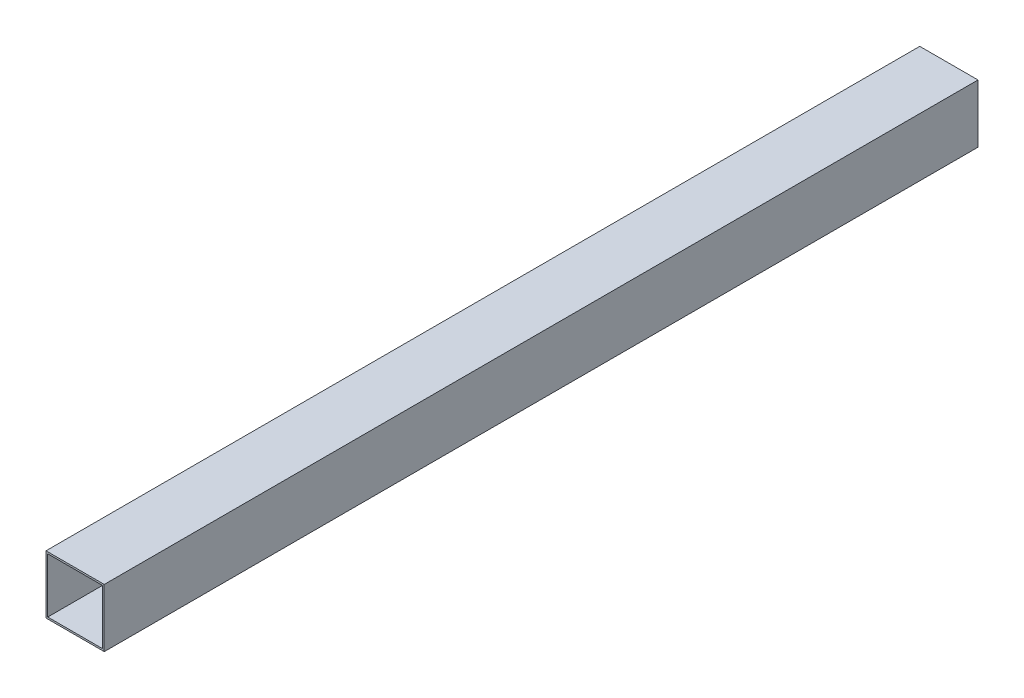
ISO-10303-21;
HEADER;
FILE_DESCRIPTION(('STEP AP214'),'2;1');
FILE_NAME('part.step','',(''),(''),'','','');
FILE_SCHEMA(('AUTOMOTIVE_DESIGN { 1 0 10303 214 1 1 1 1 }'));
ENDSEC;
DATA;
#1=APPLICATION_CONTEXT('core data for automotive mechanical design processes');
#2=APPLICATION_PROTOCOL_DEFINITION('international standard','automotive_design',2000,#1);
#3=PRODUCT_CONTEXT('',#1,'mechanical');
#4=PRODUCT('Part','Part','',(#3));
#5=PRODUCT_RELATED_PRODUCT_CATEGORY('part','',(#4));
#6=PRODUCT_DEFINITION_FORMATION('','',#4);
#7=PRODUCT_DEFINITION_CONTEXT('part definition',#1,'design');
#8=PRODUCT_DEFINITION('design','',#6,#7);
#9=PRODUCT_DEFINITION_SHAPE('','',#8);
#10=(LENGTH_UNIT() NAMED_UNIT(*) SI_UNIT(.MILLI.,.METRE.));
#11=(NAMED_UNIT(*) PLANE_ANGLE_UNIT() SI_UNIT($,.RADIAN.));
#12=(NAMED_UNIT(*) SI_UNIT($,.STERADIAN.) SOLID_ANGLE_UNIT());
#13=UNCERTAINTY_MEASURE_WITH_UNIT(LENGTH_MEASURE(1.E-05),#10,'distance_accuracy_value','');
#14=(GEOMETRIC_REPRESENTATION_CONTEXT(3) GLOBAL_UNCERTAINTY_ASSIGNED_CONTEXT((#13)) GLOBAL_UNIT_ASSIGNED_CONTEXT((#10,
#11,#12)) REPRESENTATION_CONTEXT('',''));
#15=CARTESIAN_POINT('',(0.,0.,0.));
#16=DIRECTION('',(0.,0.,1.));
#17=DIRECTION('',(1.,0.,0.));
#18=AXIS2_PLACEMENT_3D('',#15,#16,#17);
#19=CARTESIAN_POINT('',(0.,0.,600.));
#20=DIRECTION('',(0.,0.,1.));
#21=DIRECTION('',(1.,0.,0.));
#22=AXIS2_PLACEMENT_3D('',#19,#20,#21);
#23=PLANE('',#22);
#24=DIRECTION('',(0.,1.,0.));
#25=VECTOR('',#24,1.);
#26=CARTESIAN_POINT('',(20.,-20.,600.));
#27=LINE('',#26,#25);
#28=CARTESIAN_POINT('',(20.,-20.,600.));
#29=VERTEX_POINT('',#28);
#30=CARTESIAN_POINT('',(20.,20.,600.));
#31=VERTEX_POINT('',#30);
#32=EDGE_CURVE('E162',#29,#31,#27,.T.);
#33=ORIENTED_EDGE('',*,*,#32,.T.);
#34=DIRECTION('',(-1.,0.,0.));
#35=VECTOR('',#34,1.);
#36=CARTESIAN_POINT('',(-20.,20.,600.));
#37=LINE('',#36,#35);
#38=CARTESIAN_POINT('',(-20.,20.,600.));
#39=VERTEX_POINT('',#38);
#40=EDGE_CURVE('E165',#31,#39,#37,.T.);
#41=ORIENTED_EDGE('',*,*,#40,.T.);
#42=DIRECTION('',(0.,-1.,0.));
#43=VECTOR('',#42,1.);
#44=CARTESIAN_POINT('',(-20.,-20.,600.));
#45=LINE('',#44,#43);
#46=CARTESIAN_POINT('',(-20.,-20.,600.));
#47=VERTEX_POINT('',#46);
#48=EDGE_CURVE('E168',#39,#47,#45,.T.);
#49=ORIENTED_EDGE('',*,*,#48,.T.);
#50=DIRECTION('',(1.,0.,0.));
#51=VECTOR('',#50,1.);
#52=CARTESIAN_POINT('',(-20.,-20.,600.));
#53=LINE('',#52,#51);
#54=EDGE_CURVE('E170',#47,#29,#53,.T.);
#55=ORIENTED_EDGE('',*,*,#54,.T.);
#56=EDGE_LOOP('',(#33,#41,#49,#55));
#57=FACE_BOUND('',#56,.T.);
#58=DIRECTION('',(-1.,0.,0.));
#59=VECTOR('',#58,1.);
#60=CARTESIAN_POINT('',(0.,18.8,600.));
#61=LINE('',#60,#59);
#62=CARTESIAN_POINT('',(18.8,18.8,600.));
#63=VERTEX_POINT('',#62);
#64=CARTESIAN_POINT('',(-18.8,18.8,600.));
#65=VERTEX_POINT('',#64);
#66=EDGE_CURVE('E134',#63,#65,#61,.T.);
#67=ORIENTED_EDGE('',*,*,#66,.F.);
#68=DIRECTION('',(0.,1.,0.));
#69=VECTOR('',#68,1.);
#70=CARTESIAN_POINT('',(18.8,0.,600.));
#71=LINE('',#70,#69);
#72=CARTESIAN_POINT('',(18.8,-18.8,600.));
#73=VERTEX_POINT('',#72);
#74=EDGE_CURVE('E126',#73,#63,#71,.T.);
#75=ORIENTED_EDGE('',*,*,#74,.F.);
#76=DIRECTION('',(1.,0.,0.));
#77=VECTOR('',#76,1.);
#78=CARTESIAN_POINT('',(0.,-18.8,600.));
#79=LINE('',#78,#77);
#80=CARTESIAN_POINT('',(-18.8,-18.8,600.));
#81=VERTEX_POINT('',#80);
#82=EDGE_CURVE('E148',#81,#73,#79,.T.);
#83=ORIENTED_EDGE('',*,*,#82,.F.);
#84=DIRECTION('',(0.,-1.,0.));
#85=VECTOR('',#84,1.);
#86=CARTESIAN_POINT('',(-18.8,0.,600.));
#87=LINE('',#86,#85);
#88=EDGE_CURVE('E146',#65,#81,#87,.T.);
#89=ORIENTED_EDGE('',*,*,#88,.F.);
#90=EDGE_LOOP('',(#67,#75,#83,#89));
#91=FACE_BOUND('',#90,.T.);
#92=ADVANCED_FACE('F61',(#57,#91),#23,.T.);
#93=CARTESIAN_POINT('',(0.,0.,0.));
#94=DIRECTION('',(0.,0.,1.));
#95=DIRECTION('',(1.,0.,0.));
#96=AXIS2_PLACEMENT_3D('',#93,#94,#95);
#97=PLANE('',#96);
#98=DIRECTION('',(0.,1.,0.));
#99=VECTOR('',#98,1.);
#100=CARTESIAN_POINT('',(20.,-20.,0.));
#101=LINE('',#100,#99);
#102=CARTESIAN_POINT('',(20.,-20.,0.));
#103=VERTEX_POINT('',#102);
#104=CARTESIAN_POINT('',(20.,20.,0.));
#105=VERTEX_POINT('',#104);
#106=EDGE_CURVE('E142',#103,#105,#101,.T.);
#107=ORIENTED_EDGE('',*,*,#106,.F.);
#108=DIRECTION('',(1.,0.,0.));
#109=VECTOR('',#108,1.);
#110=CARTESIAN_POINT('',(-20.,-20.,0.));
#111=LINE('',#110,#109);
#112=CARTESIAN_POINT('',(-20.,-20.,0.));
#113=VERTEX_POINT('',#112);
#114=EDGE_CURVE('E166',#113,#103,#111,.T.);
#115=ORIENTED_EDGE('',*,*,#114,.F.);
#116=DIRECTION('',(0.,-1.,0.));
#117=VECTOR('',#116,1.);
#118=CARTESIAN_POINT('',(-20.,-20.,0.));
#119=LINE('',#118,#117);
#120=CARTESIAN_POINT('',(-20.,20.,0.));
#121=VERTEX_POINT('',#120);
#122=EDGE_CURVE('E177',#121,#113,#119,.T.);
#123=ORIENTED_EDGE('',*,*,#122,.F.);
#124=DIRECTION('',(-1.,0.,0.));
#125=VECTOR('',#124,1.);
#126=CARTESIAN_POINT('',(-20.,20.,0.));
#127=LINE('',#126,#125);
#128=EDGE_CURVE('E175',#105,#121,#127,.T.);
#129=ORIENTED_EDGE('',*,*,#128,.F.);
#130=EDGE_LOOP('',(#107,#115,#123,#129));
#131=FACE_BOUND('',#130,.T.);
#132=DIRECTION('',(0.,1.,0.));
#133=VECTOR('',#132,1.);
#134=CARTESIAN_POINT('',(18.8,0.,0.));
#135=LINE('',#134,#133);
#136=CARTESIAN_POINT('',(18.8,-18.8,0.));
#137=VERTEX_POINT('',#136);
#138=CARTESIAN_POINT('',(18.8,18.8,0.));
#139=VERTEX_POINT('',#138);
#140=EDGE_CURVE('E84',#137,#139,#135,.T.);
#141=ORIENTED_EDGE('',*,*,#140,.T.);
#142=DIRECTION('',(-1.,0.,0.));
#143=VECTOR('',#142,1.);
#144=CARTESIAN_POINT('',(0.,18.8,0.));
#145=LINE('',#144,#143);
#146=CARTESIAN_POINT('',(-18.8,18.8,0.));
#147=VERTEX_POINT('',#146);
#148=EDGE_CURVE('E141',#139,#147,#145,.T.);
#149=ORIENTED_EDGE('',*,*,#148,.T.);
#150=DIRECTION('',(0.,-1.,0.));
#151=VECTOR('',#150,1.);
#152=CARTESIAN_POINT('',(-18.8,0.,0.));
#153=LINE('',#152,#151);
#154=CARTESIAN_POINT('',(-18.8,-18.8,0.));
#155=VERTEX_POINT('',#154);
#156=EDGE_CURVE('E154',#147,#155,#153,.T.);
#157=ORIENTED_EDGE('',*,*,#156,.T.);
#158=DIRECTION('',(1.,0.,0.));
#159=VECTOR('',#158,1.);
#160=CARTESIAN_POINT('',(0.,-18.8,0.));
#161=LINE('',#160,#159);
#162=EDGE_CURVE('E135',#155,#137,#161,.T.);
#163=ORIENTED_EDGE('',*,*,#162,.T.);
#164=EDGE_LOOP('',(#141,#149,#157,#163));
#165=FACE_BOUND('',#164,.T.);
#166=ADVANCED_FACE('F195',(#131,#165),#97,.F.);
#167=CARTESIAN_POINT('',(20.,-20.,600.));
#168=DIRECTION('',(-1.,0.,0.));
#169=DIRECTION('',(0.,0.,1.));
#170=AXIS2_PLACEMENT_3D('',#167,#168,#169);
#171=PLANE('',#170);
#172=ORIENTED_EDGE('',*,*,#106,.T.);
#173=DIRECTION('',(0.,0.,-1.));
#174=VECTOR('',#173,1.);
#175=CARTESIAN_POINT('',(20.,20.,600.));
#176=LINE('',#175,#174);
#177=EDGE_CURVE('E12',#31,#105,#176,.T.);
#178=ORIENTED_EDGE('',*,*,#177,.F.);
#179=ORIENTED_EDGE('',*,*,#32,.F.);
#180=DIRECTION('',(0.,0.,-1.));
#181=VECTOR('',#180,1.);
#182=CARTESIAN_POINT('',(20.,-20.,600.));
#183=LINE('',#182,#181);
#184=EDGE_CURVE('E172',#29,#103,#183,.T.);
#185=ORIENTED_EDGE('',*,*,#184,.T.);
#186=EDGE_LOOP('',(#172,#178,#179,#185));
#187=FACE_BOUND('',#186,.T.);
#188=ADVANCED_FACE('F63',(#187),#171,.F.);
#189=CARTESIAN_POINT('',(-20.,20.,600.));
#190=DIRECTION('',(0.,-1.,0.));
#191=DIRECTION('',(0.,0.,-1.));
#192=AXIS2_PLACEMENT_3D('',#189,#190,#191);
#193=PLANE('',#192);
#194=ORIENTED_EDGE('',*,*,#128,.T.);
#195=DIRECTION('',(0.,0.,-1.));
#196=VECTOR('',#195,1.);
#197=CARTESIAN_POINT('',(-20.,20.,600.));
#198=LINE('',#197,#196);
#199=EDGE_CURVE('E69',#39,#121,#198,.T.);
#200=ORIENTED_EDGE('',*,*,#199,.F.);
#201=ORIENTED_EDGE('',*,*,#40,.F.);
#202=ORIENTED_EDGE('',*,*,#177,.T.);
#203=EDGE_LOOP('',(#194,#200,#201,#202));
#204=FACE_BOUND('',#203,.T.);
#205=ADVANCED_FACE('F205',(#204),#193,.F.);
#206=CARTESIAN_POINT('',(-20.,-20.,600.));
#207=DIRECTION('',(1.,0.,0.));
#208=DIRECTION('',(0.,0.,-1.));
#209=AXIS2_PLACEMENT_3D('',#206,#207,#208);
#210=PLANE('',#209);
#211=ORIENTED_EDGE('',*,*,#122,.T.);
#212=DIRECTION('',(0.,0.,-1.));
#213=VECTOR('',#212,1.);
#214=CARTESIAN_POINT('',(-20.,-20.,600.));
#215=LINE('',#214,#213);
#216=EDGE_CURVE('E182',#47,#113,#215,.T.);
#217=ORIENTED_EDGE('',*,*,#216,.F.);
#218=ORIENTED_EDGE('',*,*,#48,.F.);
#219=ORIENTED_EDGE('',*,*,#199,.T.);
#220=EDGE_LOOP('',(#211,#217,#218,#219));
#221=FACE_BOUND('',#220,.T.);
#222=ADVANCED_FACE('F189',(#221),#210,.F.);
#223=CARTESIAN_POINT('',(-20.,-20.,600.));
#224=DIRECTION('',(0.,1.,0.));
#225=DIRECTION('',(0.,0.,1.));
#226=AXIS2_PLACEMENT_3D('',#223,#224,#225);
#227=PLANE('',#226);
#228=ORIENTED_EDGE('',*,*,#114,.T.);
#229=ORIENTED_EDGE('',*,*,#184,.F.);
#230=ORIENTED_EDGE('',*,*,#54,.F.);
#231=ORIENTED_EDGE('',*,*,#216,.T.);
#232=EDGE_LOOP('',(#228,#229,#230,#231));
#233=FACE_BOUND('',#232,.T.);
#234=ADVANCED_FACE('F199',(#233),#227,.F.);
#235=CARTESIAN_POINT('',(18.8,0.,600.));
#236=DIRECTION('',(-1.,0.,0.));
#237=DIRECTION('',(0.,0.,1.));
#238=AXIS2_PLACEMENT_3D('',#235,#236,#237);
#239=PLANE('',#238);
#240=ORIENTED_EDGE('',*,*,#140,.F.);
#241=DIRECTION('',(0.,0.,-1.));
#242=VECTOR('',#241,1.);
#243=CARTESIAN_POINT('',(18.8,-18.8,600.));
#244=LINE('',#243,#242);
#245=EDGE_CURVE('E130',#73,#137,#244,.T.);
#246=ORIENTED_EDGE('',*,*,#245,.F.);
#247=ORIENTED_EDGE('',*,*,#74,.T.);
#248=DIRECTION('',(0.,0.,-1.));
#249=VECTOR('',#248,1.);
#250=CARTESIAN_POINT('',(18.8,18.8,600.));
#251=LINE('',#250,#249);
#252=EDGE_CURVE('E129',#63,#139,#251,.T.);
#253=ORIENTED_EDGE('',*,*,#252,.T.);
#254=EDGE_LOOP('',(#240,#246,#247,#253));
#255=FACE_BOUND('',#254,.T.);
#256=ADVANCED_FACE('F128',(#255),#239,.T.);
#257=CARTESIAN_POINT('',(0.,18.8,600.));
#258=DIRECTION('',(0.,-1.,0.));
#259=DIRECTION('',(0.,0.,-1.));
#260=AXIS2_PLACEMENT_3D('',#257,#258,#259);
#261=PLANE('',#260);
#262=ORIENTED_EDGE('',*,*,#148,.F.);
#263=ORIENTED_EDGE('',*,*,#252,.F.);
#264=ORIENTED_EDGE('',*,*,#66,.T.);
#265=DIRECTION('',(0.,0.,-1.));
#266=VECTOR('',#265,1.);
#267=CARTESIAN_POINT('',(-18.8,18.8,600.));
#268=LINE('',#267,#266);
#269=EDGE_CURVE('E143',#65,#147,#268,.T.);
#270=ORIENTED_EDGE('',*,*,#269,.T.);
#271=EDGE_LOOP('',(#262,#263,#264,#270));
#272=FACE_BOUND('',#271,.T.);
#273=ADVANCED_FACE('F138',(#272),#261,.T.);
#274=CARTESIAN_POINT('',(-18.8,0.,600.));
#275=DIRECTION('',(1.,0.,0.));
#276=DIRECTION('',(0.,0.,-1.));
#277=AXIS2_PLACEMENT_3D('',#274,#275,#276);
#278=PLANE('',#277);
#279=ORIENTED_EDGE('',*,*,#156,.F.);
#280=ORIENTED_EDGE('',*,*,#269,.F.);
#281=ORIENTED_EDGE('',*,*,#88,.T.);
#282=DIRECTION('',(0.,0.,-1.));
#283=VECTOR('',#282,1.);
#284=CARTESIAN_POINT('',(-18.8,-18.8,600.));
#285=LINE('',#284,#283);
#286=EDGE_CURVE('E76',#81,#155,#285,.T.);
#287=ORIENTED_EDGE('',*,*,#286,.T.);
#288=EDGE_LOOP('',(#279,#280,#281,#287));
#289=FACE_BOUND('',#288,.T.);
#290=ADVANCED_FACE('F228',(#289),#278,.T.);
#291=CARTESIAN_POINT('',(0.,-18.8,600.));
#292=DIRECTION('',(0.,1.,0.));
#293=DIRECTION('',(0.,0.,1.));
#294=AXIS2_PLACEMENT_3D('',#291,#292,#293);
#295=PLANE('',#294);
#296=ORIENTED_EDGE('',*,*,#162,.F.);
#297=ORIENTED_EDGE('',*,*,#286,.F.);
#298=ORIENTED_EDGE('',*,*,#82,.T.);
#299=ORIENTED_EDGE('',*,*,#245,.T.);
#300=EDGE_LOOP('',(#296,#297,#298,#299));
#301=FACE_BOUND('',#300,.T.);
#302=ADVANCED_FACE('F232',(#301),#295,.T.);
#303=CLOSED_SHELL('',(#92,#166,#188,#205,#222,#234,#256,#273,#290,#302));
#304=MANIFOLD_SOLID_BREP('B2',#303);
#305=ADVANCED_BREP_SHAPE_REPRESENTATION('',(#18,#304),#14);
#306=SHAPE_DEFINITION_REPRESENTATION(#9,#305);
ENDSEC;
END-ISO-10303-21;
